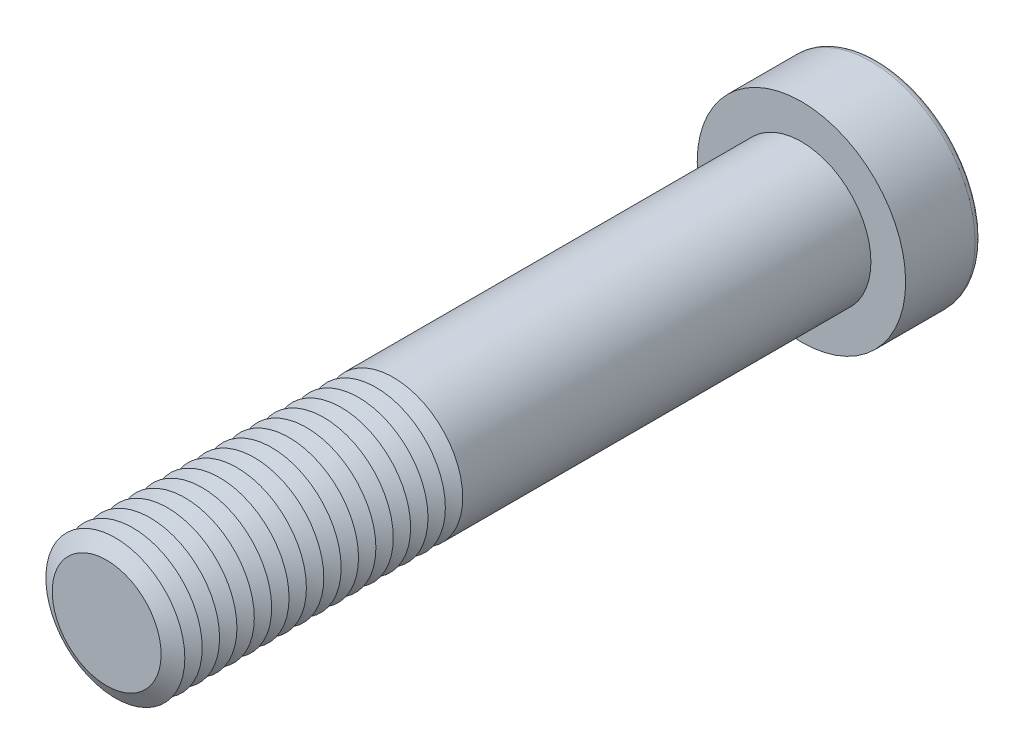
ISO-10303-21;
HEADER;
FILE_DESCRIPTION(('STEP AP214'),'2;1');
FILE_NAME('part.step','',(''),(''),'','','');
FILE_SCHEMA(('AUTOMOTIVE_DESIGN { 1 0 10303 214 1 1 1 1 }'));
ENDSEC;
DATA;
#1=APPLICATION_CONTEXT('core data for automotive mechanical design processes');
#2=APPLICATION_PROTOCOL_DEFINITION('international standard','automotive_design',2000,#1);
#3=PRODUCT_CONTEXT('',#1,'mechanical');
#4=PRODUCT('Part','Part','',(#3));
#5=PRODUCT_RELATED_PRODUCT_CATEGORY('part','',(#4));
#6=PRODUCT_DEFINITION_FORMATION('','',#4);
#7=PRODUCT_DEFINITION_CONTEXT('part definition',#1,'design');
#8=PRODUCT_DEFINITION('design','',#6,#7);
#9=PRODUCT_DEFINITION_SHAPE('','',#8);
#10=(LENGTH_UNIT() NAMED_UNIT(*) SI_UNIT(.MILLI.,.METRE.));
#11=(NAMED_UNIT(*) PLANE_ANGLE_UNIT() SI_UNIT($,.RADIAN.));
#12=(NAMED_UNIT(*) SI_UNIT($,.STERADIAN.) SOLID_ANGLE_UNIT());
#13=UNCERTAINTY_MEASURE_WITH_UNIT(LENGTH_MEASURE(1.E-05),#10,'distance_accuracy_value','');
#14=(GEOMETRIC_REPRESENTATION_CONTEXT(3) GLOBAL_UNCERTAINTY_ASSIGNED_CONTEXT((#13)) GLOBAL_UNIT_ASSIGNED_CONTEXT((#10,
#11,#12)) REPRESENTATION_CONTEXT('',''));
#15=CARTESIAN_POINT('',(0.,0.,0.));
#16=DIRECTION('',(0.,0.,1.));
#17=DIRECTION('',(1.,0.,0.));
#18=AXIS2_PLACEMENT_3D('',#15,#16,#17);
#19=CARTESIAN_POINT('',(0.,0.,91.25));
#20=DIRECTION('',(0.,0.,1.));
#21=DIRECTION('',(1.,0.,0.));
#22=AXIS2_PLACEMENT_3D('',#19,#20,#21);
#23=CONICAL_SURFACE('',#22,10.,1.0471975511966);
#24=CARTESIAN_POINT('',(0.,0.,90.));
#25=DIRECTION('',(0.,0.,1.));
#26=DIRECTION('',(1.,0.,0.));
#27=AXIS2_PLACEMENT_3D('',#24,#25,#26);
#28=CIRCLE('',#27,7.8349364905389);
#29=CARTESIAN_POINT('',(7.8349364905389,0.,90.));
#30=VERTEX_POINT('',#29);
#31=EDGE_CURVE('E314',#30,#30,#28,.T.);
#32=ORIENTED_EDGE('',*,*,#31,.T.);
#33=EDGE_LOOP('',(#32));
#34=FACE_BOUND('',#33,.T.);
#35=CARTESIAN_POINT('',(0.,0.,91.25));
#36=DIRECTION('',(0.,0.,1.));
#37=DIRECTION('',(1.,0.,0.));
#38=AXIS2_PLACEMENT_3D('',#35,#36,#37);
#39=CIRCLE('',#38,10.);
#40=CARTESIAN_POINT('',(10.,0.,91.25));
#41=VERTEX_POINT('',#40);
#42=EDGE_CURVE('E317',#41,#41,#39,.T.);
#43=ORIENTED_EDGE('',*,*,#42,.F.);
#44=EDGE_LOOP('',(#43));
#45=FACE_BOUND('',#44,.T.);
#46=ADVANCED_FACE('F39',(#34,#45),#23,.T.);
#47=CARTESIAN_POINT('',(0.,0.,90.));
#48=DIRECTION('',(0.,0.,-1.));
#49=DIRECTION('',(-1.,0.,0.));
#50=AXIS2_PLACEMENT_3D('',#47,#48,#49);
#51=CONICAL_SURFACE('',#50,7.8349364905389,1.0471975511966);
#52=CARTESIAN_POINT('',(0.,0.,88.75));
#53=DIRECTION('',(0.,0.,1.));
#54=DIRECTION('',(1.,0.,0.));
#55=AXIS2_PLACEMENT_3D('',#52,#53,#54);
#56=CIRCLE('',#55,10.);
#57=CARTESIAN_POINT('',(10.,0.,88.75));
#58=VERTEX_POINT('',#57);
#59=EDGE_CURVE('E324',#58,#58,#56,.T.);
#60=ORIENTED_EDGE('',*,*,#59,.T.);
#61=EDGE_LOOP('',(#60));
#62=FACE_BOUND('',#61,.T.);
#63=ORIENTED_EDGE('',*,*,#31,.F.);
#64=EDGE_LOOP('',(#63));
#65=FACE_BOUND('',#64,.T.);
#66=ADVANCED_FACE('F245',(#62,#65),#51,.T.);
#67=CARTESIAN_POINT('',(0.,0.,100.));
#68=DIRECTION('',(0.,0.,1.));
#69=DIRECTION('',(1.,0.,0.));
#70=AXIS2_PLACEMENT_3D('',#67,#68,#69);
#71=PLANE('',#70);
#72=CARTESIAN_POINT('',(0.,0.,100.));
#73=DIRECTION('',(0.,0.,1.));
#74=DIRECTION('',(1.,0.,0.));
#75=AXIS2_PLACEMENT_3D('',#72,#73,#74);
#76=CIRCLE('',#75,7.8349364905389);
#77=CARTESIAN_POINT('',(7.8349364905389,0.,100.));
#78=VERTEX_POINT('',#77);
#79=EDGE_CURVE('E174',#78,#78,#76,.T.);
#80=ORIENTED_EDGE('',*,*,#79,.T.);
#81=EDGE_LOOP('',(#80));
#82=FACE_BOUND('',#81,.T.);
#83=ADVANCED_FACE('F251',(#82),#71,.T.);
#84=CARTESIAN_POINT('',(0.,0.,100.));
#85=DIRECTION('',(0.,0.,-1.));
#86=DIRECTION('',(-1.,0.,0.));
#87=AXIS2_PLACEMENT_3D('',#84,#85,#86);
#88=CONICAL_SURFACE('',#87,7.8349364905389,1.0471975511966);
#89=CARTESIAN_POINT('',(0.,0.,98.75));
#90=DIRECTION('',(0.,0.,1.));
#91=DIRECTION('',(1.,0.,0.));
#92=AXIS2_PLACEMENT_3D('',#89,#90,#91);
#93=CIRCLE('',#92,10.);
#94=CARTESIAN_POINT('',(10.,0.,98.75));
#95=VERTEX_POINT('',#94);
#96=EDGE_CURVE('E291',#95,#95,#93,.T.);
#97=ORIENTED_EDGE('',*,*,#96,.T.);
#98=EDGE_LOOP('',(#97));
#99=FACE_BOUND('',#98,.T.);
#100=ORIENTED_EDGE('',*,*,#79,.F.);
#101=EDGE_LOOP('',(#100));
#102=FACE_BOUND('',#101,.T.);
#103=ADVANCED_FACE('F199',(#99,#102),#88,.T.);
#104=CARTESIAN_POINT('',(0.,0.,98.75));
#105=DIRECTION('',(0.,0.,1.));
#106=DIRECTION('',(1.,0.,0.));
#107=AXIS2_PLACEMENT_3D('',#104,#105,#106);
#108=CONICAL_SURFACE('',#107,10.,1.0471975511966);
#109=CARTESIAN_POINT('',(0.,0.,97.5));
#110=DIRECTION('',(0.,0.,1.));
#111=DIRECTION('',(1.,0.,0.));
#112=AXIS2_PLACEMENT_3D('',#109,#110,#111);
#113=CIRCLE('',#112,7.8349364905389);
#114=CARTESIAN_POINT('',(7.8349364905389,0.,97.5));
#115=VERTEX_POINT('',#114);
#116=EDGE_CURVE('E288',#115,#115,#113,.T.);
#117=ORIENTED_EDGE('',*,*,#116,.T.);
#118=EDGE_LOOP('',(#117));
#119=FACE_BOUND('',#118,.T.);
#120=ORIENTED_EDGE('',*,*,#96,.F.);
#121=EDGE_LOOP('',(#120));
#122=FACE_BOUND('',#121,.T.);
#123=ADVANCED_FACE('F277',(#119,#122),#108,.T.);
#124=CARTESIAN_POINT('',(0.,0.,97.5));
#125=DIRECTION('',(0.,0.,-1.));
#126=DIRECTION('',(-1.,0.,0.));
#127=AXIS2_PLACEMENT_3D('',#124,#125,#126);
#128=CONICAL_SURFACE('',#127,7.8349364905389,1.0471975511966);
#129=CARTESIAN_POINT('',(0.,0.,96.25));
#130=DIRECTION('',(0.,0.,1.));
#131=DIRECTION('',(1.,0.,0.));
#132=AXIS2_PLACEMENT_3D('',#129,#130,#131);
#133=CIRCLE('',#132,10.);
#134=CARTESIAN_POINT('',(10.,0.,96.25));
#135=VERTEX_POINT('',#134);
#136=EDGE_CURVE('E300',#135,#135,#133,.T.);
#137=ORIENTED_EDGE('',*,*,#136,.T.);
#138=EDGE_LOOP('',(#137));
#139=FACE_BOUND('',#138,.T.);
#140=ORIENTED_EDGE('',*,*,#116,.F.);
#141=EDGE_LOOP('',(#140));
#142=FACE_BOUND('',#141,.T.);
#143=ADVANCED_FACE('F274',(#139,#142),#128,.T.);
#144=CARTESIAN_POINT('',(0.,0.,96.25));
#145=DIRECTION('',(0.,0.,1.));
#146=DIRECTION('',(1.,0.,0.));
#147=AXIS2_PLACEMENT_3D('',#144,#145,#146);
#148=CONICAL_SURFACE('',#147,10.,1.0471975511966);
#149=CARTESIAN_POINT('',(0.,0.,95.));
#150=DIRECTION('',(0.,0.,1.));
#151=DIRECTION('',(1.,0.,0.));
#152=AXIS2_PLACEMENT_3D('',#149,#150,#151);
#153=CIRCLE('',#152,7.8349364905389);
#154=CARTESIAN_POINT('',(7.8349364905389,0.,95.));
#155=VERTEX_POINT('',#154);
#156=EDGE_CURVE('E293',#155,#155,#153,.T.);
#157=ORIENTED_EDGE('',*,*,#156,.T.);
#158=EDGE_LOOP('',(#157));
#159=FACE_BOUND('',#158,.T.);
#160=ORIENTED_EDGE('',*,*,#136,.F.);
#161=EDGE_LOOP('',(#160));
#162=FACE_BOUND('',#161,.T.);
#163=ADVANCED_FACE('F270',(#159,#162),#148,.T.);
#164=CARTESIAN_POINT('',(0.,0.,95.));
#165=DIRECTION('',(0.,0.,-1.));
#166=DIRECTION('',(-1.,0.,0.));
#167=AXIS2_PLACEMENT_3D('',#164,#165,#166);
#168=CONICAL_SURFACE('',#167,7.8349364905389,1.0471975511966);
#169=CARTESIAN_POINT('',(0.,0.,93.75));
#170=DIRECTION('',(0.,0.,1.));
#171=DIRECTION('',(1.,0.,0.));
#172=AXIS2_PLACEMENT_3D('',#169,#170,#171);
#173=CIRCLE('',#172,10.);
#174=CARTESIAN_POINT('',(10.,0.,93.75));
#175=VERTEX_POINT('',#174);
#176=EDGE_CURVE('E310',#175,#175,#173,.T.);
#177=ORIENTED_EDGE('',*,*,#176,.T.);
#178=EDGE_LOOP('',(#177));
#179=FACE_BOUND('',#178,.T.);
#180=ORIENTED_EDGE('',*,*,#156,.F.);
#181=EDGE_LOOP('',(#180));
#182=FACE_BOUND('',#181,.T.);
#183=ADVANCED_FACE('F266',(#179,#182),#168,.T.);
#184=CARTESIAN_POINT('',(0.,0.,93.75));
#185=DIRECTION('',(0.,0.,1.));
#186=DIRECTION('',(1.,0.,0.));
#187=AXIS2_PLACEMENT_3D('',#184,#185,#186);
#188=CONICAL_SURFACE('',#187,10.,1.0471975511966);
#189=CARTESIAN_POINT('',(0.,0.,92.5));
#190=DIRECTION('',(0.,0.,1.));
#191=DIRECTION('',(1.,0.,0.));
#192=AXIS2_PLACEMENT_3D('',#189,#190,#191);
#193=CIRCLE('',#192,7.8349364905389);
#194=CARTESIAN_POINT('',(7.8349364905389,0.,92.5));
#195=VERTEX_POINT('',#194);
#196=EDGE_CURVE('E306',#195,#195,#193,.T.);
#197=ORIENTED_EDGE('',*,*,#196,.T.);
#198=EDGE_LOOP('',(#197));
#199=FACE_BOUND('',#198,.T.);
#200=ORIENTED_EDGE('',*,*,#176,.F.);
#201=EDGE_LOOP('',(#200));
#202=FACE_BOUND('',#201,.T.);
#203=ADVANCED_FACE('F262',(#199,#202),#188,.T.);
#204=CARTESIAN_POINT('',(0.,0.,92.5));
#205=DIRECTION('',(0.,0.,-1.));
#206=DIRECTION('',(-1.,0.,0.));
#207=AXIS2_PLACEMENT_3D('',#204,#205,#206);
#208=CONICAL_SURFACE('',#207,7.8349364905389,1.0471975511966);
#209=ORIENTED_EDGE('',*,*,#42,.T.);
#210=EDGE_LOOP('',(#209));
#211=FACE_BOUND('',#210,.T.);
#212=ORIENTED_EDGE('',*,*,#196,.F.);
#213=EDGE_LOOP('',(#212));
#214=FACE_BOUND('',#213,.T.);
#215=ADVANCED_FACE('F258',(#211,#214),#208,.T.);
#216=CARTESIAN_POINT('',(0.,0.,88.75));
#217=DIRECTION('',(0.,0.,1.));
#218=DIRECTION('',(1.,0.,0.));
#219=AXIS2_PLACEMENT_3D('',#216,#217,#218);
#220=CONICAL_SURFACE('',#219,10.,1.0471975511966);
#221=CARTESIAN_POINT('',(0.,0.,87.5));
#222=DIRECTION('',(0.,0.,1.));
#223=DIRECTION('',(1.,0.,0.));
#224=AXIS2_PLACEMENT_3D('',#221,#222,#223);
#225=CIRCLE('',#224,7.8349364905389);
#226=CARTESIAN_POINT('',(7.8349364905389,0.,87.5));
#227=VERTEX_POINT('',#226);
#228=EDGE_CURVE('E320',#227,#227,#225,.T.);
#229=ORIENTED_EDGE('',*,*,#228,.T.);
#230=EDGE_LOOP('',(#229));
#231=FACE_BOUND('',#230,.T.);
#232=ORIENTED_EDGE('',*,*,#59,.F.);
#233=EDGE_LOOP('',(#232));
#234=FACE_BOUND('',#233,.T.);
#235=ADVANCED_FACE('F261',(#231,#234),#220,.T.);
#236=CARTESIAN_POINT('',(0.,0.,87.5));
#237=DIRECTION('',(0.,0.,-1.));
#238=DIRECTION('',(-1.,0.,0.));
#239=AXIS2_PLACEMENT_3D('',#236,#237,#238);
#240=CONICAL_SURFACE('',#239,7.8349364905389,1.0471975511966);
#241=CARTESIAN_POINT('',(0.,0.,86.25));
#242=DIRECTION('',(0.,0.,1.));
#243=DIRECTION('',(1.,0.,0.));
#244=AXIS2_PLACEMENT_3D('',#241,#242,#243);
#245=CIRCLE('',#244,10.);
#246=CARTESIAN_POINT('',(10.,0.,86.25));
#247=VERTEX_POINT('',#246);
#248=EDGE_CURVE('E332',#247,#247,#245,.T.);
#249=ORIENTED_EDGE('',*,*,#248,.T.);
#250=EDGE_LOOP('',(#249));
#251=FACE_BOUND('',#250,.T.);
#252=ORIENTED_EDGE('',*,*,#228,.F.);
#253=EDGE_LOOP('',(#252));
#254=FACE_BOUND('',#253,.T.);
#255=ADVANCED_FACE('F510',(#251,#254),#240,.T.);
#256=CARTESIAN_POINT('',(0.,0.,86.25));
#257=DIRECTION('',(0.,0.,1.));
#258=DIRECTION('',(1.,0.,0.));
#259=AXIS2_PLACEMENT_3D('',#256,#257,#258);
#260=CONICAL_SURFACE('',#259,10.,1.0471975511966);
#261=CARTESIAN_POINT('',(0.,0.,85.));
#262=DIRECTION('',(0.,0.,1.));
#263=DIRECTION('',(1.,0.,0.));
#264=AXIS2_PLACEMENT_3D('',#261,#262,#263);
#265=CIRCLE('',#264,7.8349364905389);
#266=CARTESIAN_POINT('',(7.8349364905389,0.,85.));
#267=VERTEX_POINT('',#266);
#268=EDGE_CURVE('E328',#267,#267,#265,.T.);
#269=ORIENTED_EDGE('',*,*,#268,.T.);
#270=EDGE_LOOP('',(#269));
#271=FACE_BOUND('',#270,.T.);
#272=ORIENTED_EDGE('',*,*,#248,.F.);
#273=EDGE_LOOP('',(#272));
#274=FACE_BOUND('',#273,.T.);
#275=ADVANCED_FACE('F506',(#271,#274),#260,.T.);
#276=CARTESIAN_POINT('',(0.,0.,85.));
#277=DIRECTION('',(0.,0.,-1.));
#278=DIRECTION('',(-1.,0.,0.));
#279=AXIS2_PLACEMENT_3D('',#276,#277,#278);
#280=CONICAL_SURFACE('',#279,7.8349364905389,1.0471975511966);
#281=CARTESIAN_POINT('',(0.,0.,83.75));
#282=DIRECTION('',(0.,0.,1.));
#283=DIRECTION('',(1.,0.,0.));
#284=AXIS2_PLACEMENT_3D('',#281,#282,#283);
#285=CIRCLE('',#284,10.);
#286=CARTESIAN_POINT('',(10.,0.,83.75));
#287=VERTEX_POINT('',#286);
#288=EDGE_CURVE('E340',#287,#287,#285,.T.);
#289=ORIENTED_EDGE('',*,*,#288,.T.);
#290=EDGE_LOOP('',(#289));
#291=FACE_BOUND('',#290,.T.);
#292=ORIENTED_EDGE('',*,*,#268,.F.);
#293=EDGE_LOOP('',(#292));
#294=FACE_BOUND('',#293,.T.);
#295=ADVANCED_FACE('F502',(#291,#294),#280,.T.);
#296=CARTESIAN_POINT('',(0.,0.,83.75));
#297=DIRECTION('',(0.,0.,1.));
#298=DIRECTION('',(1.,0.,0.));
#299=AXIS2_PLACEMENT_3D('',#296,#297,#298);
#300=CONICAL_SURFACE('',#299,10.,1.0471975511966);
#301=CARTESIAN_POINT('',(0.,0.,82.5));
#302=DIRECTION('',(0.,0.,1.));
#303=DIRECTION('',(1.,0.,0.));
#304=AXIS2_PLACEMENT_3D('',#301,#302,#303);
#305=CIRCLE('',#304,7.8349364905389);
#306=CARTESIAN_POINT('',(7.8349364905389,0.,82.5));
#307=VERTEX_POINT('',#306);
#308=EDGE_CURVE('E336',#307,#307,#305,.T.);
#309=ORIENTED_EDGE('',*,*,#308,.T.);
#310=EDGE_LOOP('',(#309));
#311=FACE_BOUND('',#310,.T.);
#312=ORIENTED_EDGE('',*,*,#288,.F.);
#313=EDGE_LOOP('',(#312));
#314=FACE_BOUND('',#313,.T.);
#315=ADVANCED_FACE('F498',(#311,#314),#300,.T.);
#316=CARTESIAN_POINT('',(0.,0.,82.5));
#317=DIRECTION('',(0.,0.,-1.));
#318=DIRECTION('',(-1.,0.,0.));
#319=AXIS2_PLACEMENT_3D('',#316,#317,#318);
#320=CONICAL_SURFACE('',#319,7.8349364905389,1.0471975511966);
#321=CARTESIAN_POINT('',(0.,0.,81.25));
#322=DIRECTION('',(0.,0.,1.));
#323=DIRECTION('',(1.,0.,0.));
#324=AXIS2_PLACEMENT_3D('',#321,#322,#323);
#325=CIRCLE('',#324,10.);
#326=CARTESIAN_POINT('',(10.,0.,81.25));
#327=VERTEX_POINT('',#326);
#328=EDGE_CURVE('E348',#327,#327,#325,.T.);
#329=ORIENTED_EDGE('',*,*,#328,.T.);
#330=EDGE_LOOP('',(#329));
#331=FACE_BOUND('',#330,.T.);
#332=ORIENTED_EDGE('',*,*,#308,.F.);
#333=EDGE_LOOP('',(#332));
#334=FACE_BOUND('',#333,.T.);
#335=ADVANCED_FACE('F494',(#331,#334),#320,.T.);
#336=CARTESIAN_POINT('',(0.,0.,81.25));
#337=DIRECTION('',(0.,0.,1.));
#338=DIRECTION('',(1.,0.,0.));
#339=AXIS2_PLACEMENT_3D('',#336,#337,#338);
#340=CONICAL_SURFACE('',#339,10.,1.0471975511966);
#341=CARTESIAN_POINT('',(0.,0.,80.));
#342=DIRECTION('',(0.,0.,1.));
#343=DIRECTION('',(1.,0.,0.));
#344=AXIS2_PLACEMENT_3D('',#341,#342,#343);
#345=CIRCLE('',#344,7.8349364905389);
#346=CARTESIAN_POINT('',(7.8349364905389,0.,80.));
#347=VERTEX_POINT('',#346);
#348=EDGE_CURVE('E344',#347,#347,#345,.T.);
#349=ORIENTED_EDGE('',*,*,#348,.T.);
#350=EDGE_LOOP('',(#349));
#351=FACE_BOUND('',#350,.T.);
#352=ORIENTED_EDGE('',*,*,#328,.F.);
#353=EDGE_LOOP('',(#352));
#354=FACE_BOUND('',#353,.T.);
#355=ADVANCED_FACE('F490',(#351,#354),#340,.T.);
#356=CARTESIAN_POINT('',(0.,0.,80.));
#357=DIRECTION('',(0.,0.,-1.));
#358=DIRECTION('',(-1.,0.,0.));
#359=AXIS2_PLACEMENT_3D('',#356,#357,#358);
#360=CONICAL_SURFACE('',#359,7.8349364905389,1.0471975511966);
#361=CARTESIAN_POINT('',(0.,0.,78.75));
#362=DIRECTION('',(0.,0.,1.));
#363=DIRECTION('',(1.,0.,0.));
#364=AXIS2_PLACEMENT_3D('',#361,#362,#363);
#365=CIRCLE('',#364,10.);
#366=CARTESIAN_POINT('',(10.,0.,78.75));
#367=VERTEX_POINT('',#366);
#368=EDGE_CURVE('E356',#367,#367,#365,.T.);
#369=ORIENTED_EDGE('',*,*,#368,.T.);
#370=EDGE_LOOP('',(#369));
#371=FACE_BOUND('',#370,.T.);
#372=ORIENTED_EDGE('',*,*,#348,.F.);
#373=EDGE_LOOP('',(#372));
#374=FACE_BOUND('',#373,.T.);
#375=ADVANCED_FACE('F486',(#371,#374),#360,.T.);
#376=CARTESIAN_POINT('',(0.,0.,78.75));
#377=DIRECTION('',(0.,0.,1.));
#378=DIRECTION('',(1.,0.,0.));
#379=AXIS2_PLACEMENT_3D('',#376,#377,#378);
#380=CONICAL_SURFACE('',#379,10.,1.0471975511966);
#381=CARTESIAN_POINT('',(0.,0.,77.5));
#382=DIRECTION('',(0.,0.,1.));
#383=DIRECTION('',(1.,0.,0.));
#384=AXIS2_PLACEMENT_3D('',#381,#382,#383);
#385=CIRCLE('',#384,7.8349364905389);
#386=CARTESIAN_POINT('',(7.8349364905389,0.,77.5));
#387=VERTEX_POINT('',#386);
#388=EDGE_CURVE('E352',#387,#387,#385,.T.);
#389=ORIENTED_EDGE('',*,*,#388,.T.);
#390=EDGE_LOOP('',(#389));
#391=FACE_BOUND('',#390,.T.);
#392=ORIENTED_EDGE('',*,*,#368,.F.);
#393=EDGE_LOOP('',(#392));
#394=FACE_BOUND('',#393,.T.);
#395=ADVANCED_FACE('F482',(#391,#394),#380,.T.);
#396=CARTESIAN_POINT('',(0.,0.,77.5));
#397=DIRECTION('',(0.,0.,-1.));
#398=DIRECTION('',(-1.,0.,0.));
#399=AXIS2_PLACEMENT_3D('',#396,#397,#398);
#400=CONICAL_SURFACE('',#399,7.8349364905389,1.0471975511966);
#401=CARTESIAN_POINT('',(0.,0.,76.25));
#402=DIRECTION('',(0.,0.,1.));
#403=DIRECTION('',(1.,0.,0.));
#404=AXIS2_PLACEMENT_3D('',#401,#402,#403);
#405=CIRCLE('',#404,10.);
#406=CARTESIAN_POINT('',(10.,0.,76.25));
#407=VERTEX_POINT('',#406);
#408=EDGE_CURVE('E363',#407,#407,#405,.T.);
#409=ORIENTED_EDGE('',*,*,#408,.T.);
#410=EDGE_LOOP('',(#409));
#411=FACE_BOUND('',#410,.T.);
#412=ORIENTED_EDGE('',*,*,#388,.F.);
#413=EDGE_LOOP('',(#412));
#414=FACE_BOUND('',#413,.T.);
#415=ADVANCED_FACE('F478',(#411,#414),#400,.T.);
#416=CARTESIAN_POINT('',(0.,0.,76.25));
#417=DIRECTION('',(0.,0.,1.));
#418=DIRECTION('',(1.,0.,0.));
#419=AXIS2_PLACEMENT_3D('',#416,#417,#418);
#420=CONICAL_SURFACE('',#419,10.,1.0471975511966);
#421=CARTESIAN_POINT('',(0.,0.,75.));
#422=DIRECTION('',(0.,0.,1.));
#423=DIRECTION('',(1.,0.,0.));
#424=AXIS2_PLACEMENT_3D('',#421,#422,#423);
#425=CIRCLE('',#424,7.8349364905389);
#426=CARTESIAN_POINT('',(7.8349364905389,0.,75.));
#427=VERTEX_POINT('',#426);
#428=EDGE_CURVE('E359',#427,#427,#425,.T.);
#429=ORIENTED_EDGE('',*,*,#428,.T.);
#430=EDGE_LOOP('',(#429));
#431=FACE_BOUND('',#430,.T.);
#432=ORIENTED_EDGE('',*,*,#408,.F.);
#433=EDGE_LOOP('',(#432));
#434=FACE_BOUND('',#433,.T.);
#435=ADVANCED_FACE('F474',(#431,#434),#420,.T.);
#436=CARTESIAN_POINT('',(0.,0.,75.));
#437=DIRECTION('',(0.,0.,-1.));
#438=DIRECTION('',(-1.,0.,0.));
#439=AXIS2_PLACEMENT_3D('',#436,#437,#438);
#440=CONICAL_SURFACE('',#439,7.8349364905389,1.0471975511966);
#441=CARTESIAN_POINT('',(0.,0.,73.75));
#442=DIRECTION('',(0.,0.,1.));
#443=DIRECTION('',(1.,0.,0.));
#444=AXIS2_PLACEMENT_3D('',#441,#442,#443);
#445=CIRCLE('',#444,10.);
#446=CARTESIAN_POINT('',(10.,0.,73.75));
#447=VERTEX_POINT('',#446);
#448=EDGE_CURVE('E370',#447,#447,#445,.T.);
#449=ORIENTED_EDGE('',*,*,#448,.T.);
#450=EDGE_LOOP('',(#449));
#451=FACE_BOUND('',#450,.T.);
#452=ORIENTED_EDGE('',*,*,#428,.F.);
#453=EDGE_LOOP('',(#452));
#454=FACE_BOUND('',#453,.T.);
#455=ADVANCED_FACE('F470',(#451,#454),#440,.T.);
#456=CARTESIAN_POINT('',(0.,0.,73.75));
#457=DIRECTION('',(0.,0.,1.));
#458=DIRECTION('',(1.,0.,0.));
#459=AXIS2_PLACEMENT_3D('',#456,#457,#458);
#460=CONICAL_SURFACE('',#459,10.,1.0471975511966);
#461=CARTESIAN_POINT('',(0.,0.,72.5));
#462=DIRECTION('',(0.,0.,1.));
#463=DIRECTION('',(1.,0.,0.));
#464=AXIS2_PLACEMENT_3D('',#461,#462,#463);
#465=CIRCLE('',#464,7.8349364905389);
#466=CARTESIAN_POINT('',(7.8349364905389,0.,72.5));
#467=VERTEX_POINT('',#466);
#468=EDGE_CURVE('E367',#467,#467,#465,.T.);
#469=ORIENTED_EDGE('',*,*,#468,.T.);
#470=EDGE_LOOP('',(#469));
#471=FACE_BOUND('',#470,.T.);
#472=ORIENTED_EDGE('',*,*,#448,.F.);
#473=EDGE_LOOP('',(#472));
#474=FACE_BOUND('',#473,.T.);
#475=ADVANCED_FACE('F466',(#471,#474),#460,.T.);
#476=CARTESIAN_POINT('',(0.,0.,72.5));
#477=DIRECTION('',(0.,0.,-1.));
#478=DIRECTION('',(-1.,0.,0.));
#479=AXIS2_PLACEMENT_3D('',#476,#477,#478);
#480=CONICAL_SURFACE('',#479,7.8349364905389,1.0471975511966);
#481=CARTESIAN_POINT('',(0.,0.,71.25));
#482=DIRECTION('',(0.,0.,1.));
#483=DIRECTION('',(1.,0.,0.));
#484=AXIS2_PLACEMENT_3D('',#481,#482,#483);
#485=CIRCLE('',#484,10.);
#486=CARTESIAN_POINT('',(10.,0.,71.25));
#487=VERTEX_POINT('',#486);
#488=EDGE_CURVE('E378',#487,#487,#485,.T.);
#489=ORIENTED_EDGE('',*,*,#488,.T.);
#490=EDGE_LOOP('',(#489));
#491=FACE_BOUND('',#490,.T.);
#492=ORIENTED_EDGE('',*,*,#468,.F.);
#493=EDGE_LOOP('',(#492));
#494=FACE_BOUND('',#493,.T.);
#495=ADVANCED_FACE('F462',(#491,#494),#480,.T.);
#496=CARTESIAN_POINT('',(0.,0.,71.25));
#497=DIRECTION('',(0.,0.,1.));
#498=DIRECTION('',(1.,0.,0.));
#499=AXIS2_PLACEMENT_3D('',#496,#497,#498);
#500=CONICAL_SURFACE('',#499,10.,1.0471975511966);
#501=CARTESIAN_POINT('',(0.,0.,70.));
#502=DIRECTION('',(0.,0.,1.));
#503=DIRECTION('',(1.,0.,0.));
#504=AXIS2_PLACEMENT_3D('',#501,#502,#503);
#505=CIRCLE('',#504,7.8349364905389);
#506=CARTESIAN_POINT('',(7.8349364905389,0.,70.));
#507=VERTEX_POINT('',#506);
#508=EDGE_CURVE('E374',#507,#507,#505,.T.);
#509=ORIENTED_EDGE('',*,*,#508,.T.);
#510=EDGE_LOOP('',(#509));
#511=FACE_BOUND('',#510,.T.);
#512=ORIENTED_EDGE('',*,*,#488,.F.);
#513=EDGE_LOOP('',(#512));
#514=FACE_BOUND('',#513,.T.);
#515=ADVANCED_FACE('F458',(#511,#514),#500,.T.);
#516=CARTESIAN_POINT('',(0.,0.,70.));
#517=DIRECTION('',(0.,0.,-1.));
#518=DIRECTION('',(-1.,0.,0.));
#519=AXIS2_PLACEMENT_3D('',#516,#517,#518);
#520=CONICAL_SURFACE('',#519,7.8349364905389,1.0471975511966);
#521=CARTESIAN_POINT('',(0.,0.,68.75));
#522=DIRECTION('',(0.,0.,1.));
#523=DIRECTION('',(1.,0.,0.));
#524=AXIS2_PLACEMENT_3D('',#521,#522,#523);
#525=CIRCLE('',#524,10.);
#526=CARTESIAN_POINT('',(10.,0.,68.75));
#527=VERTEX_POINT('',#526);
#528=EDGE_CURVE('E386',#527,#527,#525,.T.);
#529=ORIENTED_EDGE('',*,*,#528,.T.);
#530=EDGE_LOOP('',(#529));
#531=FACE_BOUND('',#530,.T.);
#532=ORIENTED_EDGE('',*,*,#508,.F.);
#533=EDGE_LOOP('',(#532));
#534=FACE_BOUND('',#533,.T.);
#535=ADVANCED_FACE('F454',(#531,#534),#520,.T.);
#536=CARTESIAN_POINT('',(0.,0.,68.75));
#537=DIRECTION('',(0.,0.,1.));
#538=DIRECTION('',(1.,0.,0.));
#539=AXIS2_PLACEMENT_3D('',#536,#537,#538);
#540=CONICAL_SURFACE('',#539,10.,1.0471975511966);
#541=CARTESIAN_POINT('',(0.,0.,67.5));
#542=DIRECTION('',(0.,0.,1.));
#543=DIRECTION('',(1.,0.,0.));
#544=AXIS2_PLACEMENT_3D('',#541,#542,#543);
#545=CIRCLE('',#544,7.8349364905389);
#546=CARTESIAN_POINT('',(7.8349364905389,0.,67.5));
#547=VERTEX_POINT('',#546);
#548=EDGE_CURVE('E382',#547,#547,#545,.T.);
#549=ORIENTED_EDGE('',*,*,#548,.T.);
#550=EDGE_LOOP('',(#549));
#551=FACE_BOUND('',#550,.T.);
#552=ORIENTED_EDGE('',*,*,#528,.F.);
#553=EDGE_LOOP('',(#552));
#554=FACE_BOUND('',#553,.T.);
#555=ADVANCED_FACE('F450',(#551,#554),#540,.T.);
#556=CARTESIAN_POINT('',(0.,0.,67.5));
#557=DIRECTION('',(0.,0.,-1.));
#558=DIRECTION('',(-1.,0.,0.));
#559=AXIS2_PLACEMENT_3D('',#556,#557,#558);
#560=CONICAL_SURFACE('',#559,7.8349364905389,1.0471975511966);
#561=CARTESIAN_POINT('',(0.,0.,66.25));
#562=DIRECTION('',(0.,0.,1.));
#563=DIRECTION('',(1.,0.,0.));
#564=AXIS2_PLACEMENT_3D('',#561,#562,#563);
#565=CIRCLE('',#564,10.);
#566=CARTESIAN_POINT('',(10.,0.,66.25));
#567=VERTEX_POINT('',#566);
#568=EDGE_CURVE('E394',#567,#567,#565,.T.);
#569=ORIENTED_EDGE('',*,*,#568,.T.);
#570=EDGE_LOOP('',(#569));
#571=FACE_BOUND('',#570,.T.);
#572=ORIENTED_EDGE('',*,*,#548,.F.);
#573=EDGE_LOOP('',(#572));
#574=FACE_BOUND('',#573,.T.);
#575=ADVANCED_FACE('F446',(#571,#574),#560,.T.);
#576=CARTESIAN_POINT('',(0.,0.,66.25));
#577=DIRECTION('',(0.,0.,1.));
#578=DIRECTION('',(1.,0.,0.));
#579=AXIS2_PLACEMENT_3D('',#576,#577,#578);
#580=CONICAL_SURFACE('',#579,10.,1.0471975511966);
#581=CARTESIAN_POINT('',(0.,0.,65.));
#582=DIRECTION('',(0.,0.,1.));
#583=DIRECTION('',(1.,0.,0.));
#584=AXIS2_PLACEMENT_3D('',#581,#582,#583);
#585=CIRCLE('',#584,7.8349364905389);
#586=CARTESIAN_POINT('',(7.8349364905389,0.,65.));
#587=VERTEX_POINT('',#586);
#588=EDGE_CURVE('E390',#587,#587,#585,.T.);
#589=ORIENTED_EDGE('',*,*,#588,.T.);
#590=EDGE_LOOP('',(#589));
#591=FACE_BOUND('',#590,.T.);
#592=ORIENTED_EDGE('',*,*,#568,.F.);
#593=EDGE_LOOP('',(#592));
#594=FACE_BOUND('',#593,.T.);
#595=ADVANCED_FACE('F442',(#591,#594),#580,.T.);
#596=CARTESIAN_POINT('',(0.,0.,65.));
#597=DIRECTION('',(0.,0.,-1.));
#598=DIRECTION('',(-1.,0.,0.));
#599=AXIS2_PLACEMENT_3D('',#596,#597,#598);
#600=CONICAL_SURFACE('',#599,7.8349364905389,1.0471975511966);
#601=CARTESIAN_POINT('',(0.,0.,63.75));
#602=DIRECTION('',(0.,0.,1.));
#603=DIRECTION('',(1.,0.,0.));
#604=AXIS2_PLACEMENT_3D('',#601,#602,#603);
#605=CIRCLE('',#604,10.);
#606=CARTESIAN_POINT('',(10.,0.,63.75));
#607=VERTEX_POINT('',#606);
#608=EDGE_CURVE('E402',#607,#607,#605,.T.);
#609=ORIENTED_EDGE('',*,*,#608,.T.);
#610=EDGE_LOOP('',(#609));
#611=FACE_BOUND('',#610,.T.);
#612=ORIENTED_EDGE('',*,*,#588,.F.);
#613=EDGE_LOOP('',(#612));
#614=FACE_BOUND('',#613,.T.);
#615=ADVANCED_FACE('F438',(#611,#614),#600,.T.);
#616=CARTESIAN_POINT('',(0.,0.,63.75));
#617=DIRECTION('',(0.,0.,1.));
#618=DIRECTION('',(1.,0.,0.));
#619=AXIS2_PLACEMENT_3D('',#616,#617,#618);
#620=CONICAL_SURFACE('',#619,10.,1.0471975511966);
#621=CARTESIAN_POINT('',(0.,0.,62.5));
#622=DIRECTION('',(0.,0.,1.));
#623=DIRECTION('',(1.,0.,0.));
#624=AXIS2_PLACEMENT_3D('',#621,#622,#623);
#625=CIRCLE('',#624,7.8349364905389);
#626=CARTESIAN_POINT('',(7.8349364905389,0.,62.5));
#627=VERTEX_POINT('',#626);
#628=EDGE_CURVE('E398',#627,#627,#625,.T.);
#629=ORIENTED_EDGE('',*,*,#628,.T.);
#630=EDGE_LOOP('',(#629));
#631=FACE_BOUND('',#630,.T.);
#632=ORIENTED_EDGE('',*,*,#608,.F.);
#633=EDGE_LOOP('',(#632));
#634=FACE_BOUND('',#633,.T.);
#635=ADVANCED_FACE('F433',(#631,#634),#620,.T.);
#636=CARTESIAN_POINT('',(0.,0.,62.5));
#637=DIRECTION('',(0.,0.,-1.));
#638=DIRECTION('',(-1.,0.,0.));
#639=AXIS2_PLACEMENT_3D('',#636,#637,#638);
#640=CONICAL_SURFACE('',#639,7.8349364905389,1.0471975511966);
#641=CARTESIAN_POINT('',(0.,0.,61.25));
#642=DIRECTION('',(0.,0.,1.));
#643=DIRECTION('',(1.,0.,0.));
#644=AXIS2_PLACEMENT_3D('',#641,#642,#643);
#645=CIRCLE('',#644,10.);
#646=CARTESIAN_POINT('',(10.,0.,61.25));
#647=VERTEX_POINT('',#646);
#648=EDGE_CURVE('E414',#647,#647,#645,.T.);
#649=ORIENTED_EDGE('',*,*,#648,.T.);
#650=EDGE_LOOP('',(#649));
#651=FACE_BOUND('',#650,.T.);
#652=ORIENTED_EDGE('',*,*,#628,.F.);
#653=EDGE_LOOP('',(#652));
#654=FACE_BOUND('',#653,.T.);
#655=ADVANCED_FACE('F419',(#651,#654),#640,.T.);
#656=CARTESIAN_POINT('',(0.,0.,61.25));
#657=DIRECTION('',(0.,0.,1.));
#658=DIRECTION('',(1.,0.,0.));
#659=AXIS2_PLACEMENT_3D('',#656,#657,#658);
#660=CONICAL_SURFACE('',#659,10.,1.0471975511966);
#661=CARTESIAN_POINT('',(0.,0.,60.));
#662=DIRECTION('',(0.,0.,1.));
#663=DIRECTION('',(1.,0.,0.));
#664=AXIS2_PLACEMENT_3D('',#661,#662,#663);
#665=CIRCLE('',#664,7.8349364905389);
#666=CARTESIAN_POINT('',(7.8349364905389,0.,60.));
#667=VERTEX_POINT('',#666);
#668=EDGE_CURVE('E406',#667,#667,#665,.T.);
#669=ORIENTED_EDGE('',*,*,#668,.T.);
#670=EDGE_LOOP('',(#669));
#671=FACE_BOUND('',#670,.T.);
#672=ORIENTED_EDGE('',*,*,#648,.F.);
#673=EDGE_LOOP('',(#672));
#674=FACE_BOUND('',#673,.T.);
#675=ADVANCED_FACE('F422',(#671,#674),#660,.T.);
#676=CARTESIAN_POINT('',(0.,0.,60.));
#677=DIRECTION('',(0.,0.,-1.));
#678=DIRECTION('',(-1.,0.,0.));
#679=AXIS2_PLACEMENT_3D('',#676,#677,#678);
#680=CONICAL_SURFACE('',#679,7.8349364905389,1.0471975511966);
#681=CARTESIAN_POINT('',(0.,0.,58.75));
#682=DIRECTION('',(0.,0.,1.));
#683=DIRECTION('',(1.,0.,0.));
#684=AXIS2_PLACEMENT_3D('',#681,#682,#683);
#685=CIRCLE('',#684,10.);
#686=CARTESIAN_POINT('',(10.,0.,58.75));
#687=VERTEX_POINT('',#686);
#688=EDGE_CURVE('E410',#687,#687,#685,.T.);
#689=ORIENTED_EDGE('',*,*,#688,.T.);
#690=EDGE_LOOP('',(#689));
#691=FACE_BOUND('',#690,.T.);
#692=ORIENTED_EDGE('',*,*,#668,.F.);
#693=EDGE_LOOP('',(#692));
#694=FACE_BOUND('',#693,.T.);
#695=ADVANCED_FACE('F424',(#691,#694),#680,.T.);
#696=CARTESIAN_POINT('',(0.,0.,-0.499999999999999));
#697=DIRECTION('',(0.,0.,-1.));
#698=DIRECTION('',(-1.,0.,0.));
#699=AXIS2_PLACEMENT_3D('',#696,#697,#698);
#700=CONICAL_SURFACE('',#699,7.,1.0471975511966);
#701=CARTESIAN_POINT('',(0.,0.,3.54145188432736));
#702=VERTEX_POINT('',#701);
#703=VERTEX_LOOP('',#702);
#704=FACE_BOUND('',#703,.T.);
#705=CARTESIAN_POINT('',(0.,0.,-0.499999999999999));
#706=DIRECTION('',(0.,0.,-1.));
#707=DIRECTION('',(-1.,0.,0.));
#708=AXIS2_PLACEMENT_3D('',#705,#706,#707);
#709=CIRCLE('',#708,7.);
#710=CARTESIAN_POINT('',(-6.06217782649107,3.5,-0.499999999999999));
#711=VERTEX_POINT('',#710);
#712=CARTESIAN_POINT('',(0.,7.,-0.499999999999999));
#713=VERTEX_POINT('',#712);
#714=EDGE_CURVE('E149',#711,#713,#709,.T.);
#715=ORIENTED_EDGE('',*,*,#714,.T.);
#716=CARTESIAN_POINT('',(0.,0.,-0.499999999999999));
#717=DIRECTION('',(0.,0.,-1.));
#718=DIRECTION('',(-1.,0.,0.));
#719=AXIS2_PLACEMENT_3D('',#716,#717,#718);
#720=CIRCLE('',#719,7.);
#721=CARTESIAN_POINT('',(6.06217782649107,3.5,-0.499999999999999));
#722=VERTEX_POINT('',#721);
#723=EDGE_CURVE('E54',#713,#722,#720,.T.);
#724=ORIENTED_EDGE('',*,*,#723,.T.);
#725=CARTESIAN_POINT('',(6.06217782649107,-3.5,-0.499999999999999));
#726=VERTEX_POINT('',#725);
#727=EDGE_CURVE('E1025',#722,#726,#720,.T.);
#728=ORIENTED_EDGE('',*,*,#727,.T.);
#729=CARTESIAN_POINT('',(0.,-7.,-0.499999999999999));
#730=VERTEX_POINT('',#729);
#731=EDGE_CURVE('E1023',#726,#730,#720,.T.);
#732=ORIENTED_EDGE('',*,*,#731,.T.);
#733=CARTESIAN_POINT('',(-6.06217782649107,-3.5,-0.499999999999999));
#734=VERTEX_POINT('',#733);
#735=EDGE_CURVE('E1018',#730,#734,#720,.T.);
#736=ORIENTED_EDGE('',*,*,#735,.T.);
#737=EDGE_CURVE('E1016',#734,#711,#720,.T.);
#738=ORIENTED_EDGE('',*,*,#737,.T.);
#739=EDGE_LOOP('',(#715,#724,#728,#732,#736,#738));
#740=FACE_BOUND('',#739,.T.);
#741=ADVANCED_FACE('F201',(#704,#740),#700,.F.);
#742=CARTESIAN_POINT('',(0.,0.,-0.499999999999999));
#743=DIRECTION('',(0.,0.,-1.));
#744=DIRECTION('',(-1.,0.,0.));
#745=AXIS2_PLACEMENT_3D('',#742,#743,#744);
#746=PLANE('',#745);
#747=ORIENTED_EDGE('',*,*,#723,.F.);
#748=DIRECTION('',(1.,0.,0.));
#749=VECTOR('',#748,1.);
#750=CARTESIAN_POINT('',(-4.04145188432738,7.,-0.499999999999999));
#751=LINE('',#750,#749);
#752=CARTESIAN_POINT('',(4.04145188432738,7.,-0.499999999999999));
#753=VERTEX_POINT('',#752);
#754=EDGE_CURVE('E1068',#713,#753,#751,.T.);
#755=ORIENTED_EDGE('',*,*,#754,.T.);
#756=DIRECTION('',(0.5,-0.866025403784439,0.));
#757=VECTOR('',#756,1.);
#758=CARTESIAN_POINT('',(4.04145188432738,7.,-0.499999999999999));
#759=LINE('',#758,#757);
#760=EDGE_CURVE('E155',#753,#722,#759,.T.);
#761=ORIENTED_EDGE('',*,*,#760,.T.);
#762=EDGE_LOOP('',(#747,#755,#761));
#763=FACE_BOUND('',#762,.T.);
#764=ADVANCED_FACE('F605',(#763),#746,.T.);
#765=ORIENTED_EDGE('',*,*,#727,.F.);
#766=CARTESIAN_POINT('',(8.08290376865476,0.,-0.499999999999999));
#767=VERTEX_POINT('',#766);
#768=EDGE_CURVE('E1062',#722,#767,#759,.T.);
#769=ORIENTED_EDGE('',*,*,#768,.T.);
#770=DIRECTION('',(-0.5,-0.866025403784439,0.));
#771=VECTOR('',#770,1.);
#772=CARTESIAN_POINT('',(8.08290376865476,0.,-0.499999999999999));
#773=LINE('',#772,#771);
#774=EDGE_CURVE('E1037',#767,#726,#773,.T.);
#775=ORIENTED_EDGE('',*,*,#774,.T.);
#776=EDGE_LOOP('',(#765,#769,#775));
#777=FACE_BOUND('',#776,.T.);
#778=ADVANCED_FACE('F615',(#777),#746,.T.);
#779=ORIENTED_EDGE('',*,*,#731,.F.);
#780=CARTESIAN_POINT('',(4.04145188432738,-7.,-0.499999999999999));
#781=VERTEX_POINT('',#780);
#782=EDGE_CURVE('E1039',#726,#781,#773,.T.);
#783=ORIENTED_EDGE('',*,*,#782,.T.);
#784=DIRECTION('',(-1.,0.,0.));
#785=VECTOR('',#784,1.);
#786=CARTESIAN_POINT('',(4.04145188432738,-7.,-0.499999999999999));
#787=LINE('',#786,#785);
#788=EDGE_CURVE('E990',#781,#730,#787,.T.);
#789=ORIENTED_EDGE('',*,*,#788,.T.);
#790=EDGE_LOOP('',(#779,#783,#789));
#791=FACE_BOUND('',#790,.T.);
#792=ADVANCED_FACE('F625',(#791),#746,.T.);
#793=ORIENTED_EDGE('',*,*,#735,.F.);
#794=CARTESIAN_POINT('',(-4.04145188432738,-7.,-0.499999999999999));
#795=VERTEX_POINT('',#794);
#796=EDGE_CURVE('E1033',#730,#795,#787,.T.);
#797=ORIENTED_EDGE('',*,*,#796,.T.);
#798=DIRECTION('',(-0.5,0.866025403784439,0.));
#799=VECTOR('',#798,1.);
#800=CARTESIAN_POINT('',(-4.04145188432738,-7.,-0.499999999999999));
#801=LINE('',#800,#799);
#802=EDGE_CURVE('E1035',#795,#734,#801,.T.);
#803=ORIENTED_EDGE('',*,*,#802,.T.);
#804=EDGE_LOOP('',(#793,#797,#803));
#805=FACE_BOUND('',#804,.T.);
#806=ADVANCED_FACE('F633',(#805),#746,.T.);
#807=ORIENTED_EDGE('',*,*,#737,.F.);
#808=CARTESIAN_POINT('',(-8.08290376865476,0.,-0.499999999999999));
#809=VERTEX_POINT('',#808);
#810=EDGE_CURVE('E1041',#734,#809,#801,.T.);
#811=ORIENTED_EDGE('',*,*,#810,.T.);
#812=DIRECTION('',(0.5,0.866025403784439,0.));
#813=VECTOR('',#812,1.);
#814=CARTESIAN_POINT('',(-8.08290376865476,0.,-0.499999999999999));
#815=LINE('',#814,#813);
#816=EDGE_CURVE('E158',#809,#711,#815,.T.);
#817=ORIENTED_EDGE('',*,*,#816,.T.);
#818=EDGE_LOOP('',(#807,#811,#817));
#819=FACE_BOUND('',#818,.T.);
#820=ADVANCED_FACE('F231',(#819),#746,.T.);
#821=ORIENTED_EDGE('',*,*,#714,.F.);
#822=CARTESIAN_POINT('',(-4.04145188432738,7.,-0.499999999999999));
#823=VERTEX_POINT('',#822);
#824=EDGE_CURVE('E1048',#711,#823,#815,.T.);
#825=ORIENTED_EDGE('',*,*,#824,.T.);
#826=EDGE_CURVE('E1065',#823,#713,#751,.T.);
#827=ORIENTED_EDGE('',*,*,#826,.T.);
#828=EDGE_LOOP('',(#821,#825,#827));
#829=FACE_BOUND('',#828,.T.);
#830=ADVANCED_FACE('F617',(#829),#746,.T.);
#831=CARTESIAN_POINT('',(-4.04145188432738,7.,-0.499999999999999));
#832=DIRECTION('',(0.,1.,0.));
#833=DIRECTION('',(0.,0.,1.));
#834=AXIS2_PLACEMENT_3D('',#831,#832,#833);
#835=PLANE('',#834);
#836=DIRECTION('',(0.,0.,-1.));
#837=VECTOR('',#836,1.);
#838=CARTESIAN_POINT('',(-4.04145188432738,7.,-0.499999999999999));
#839=LINE('',#838,#837);
#840=CARTESIAN_POINT('',(-4.04145188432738,7.,-11.));
#841=VERTEX_POINT('',#840);
#842=EDGE_CURVE('E147',#823,#841,#839,.T.);
#843=ORIENTED_EDGE('',*,*,#842,.T.);
#844=CARTESIAN_POINT('',(-10.5504265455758,7.,-12.226809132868));
#845=CARTESIAN_POINT('',(-10.234342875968,7.,-12.1562549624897));
#846=CARTESIAN_POINT('',(-9.91805751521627,7.,-12.0865877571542));
#847=CARTESIAN_POINT('',(-9.28498462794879,7.,-11.9495060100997));
#848=CARTESIAN_POINT('',(-8.9681970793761,7.,-11.8820915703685));
#849=CARTESIAN_POINT('',(-8.3337216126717,7.,-11.7499322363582));
#850=CARTESIAN_POINT('',(-8.0160331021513,7.,-11.6851901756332));
#851=CARTESIAN_POINT('',(-7.37998429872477,7.,-11.5590967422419));
#852=CARTESIAN_POINT('',(-7.0616240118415,7.,-11.4977453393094));
#853=CARTESIAN_POINT('',(-6.42688035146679,7.,-11.3797520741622));
#854=CARTESIAN_POINT('',(-6.11050373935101,7.,-11.3230740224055));
#855=CARTESIAN_POINT('',(-5.47688007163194,7.,-11.214821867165));
#856=CARTESIAN_POINT('',(-5.15963303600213,7.,-11.1632476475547));
#857=CARTESIAN_POINT('',(-4.52422055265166,7.,-11.0663930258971));
#858=CARTESIAN_POINT('',(-4.20605525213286,7.,-11.0211116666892));
#859=CARTESIAN_POINT('',(-3.56871761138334,7.,-10.9382023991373));
#860=CARTESIAN_POINT('',(-3.24954527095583,7.,-10.9005744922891));
#861=CARTESIAN_POINT('',(-2.60663136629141,7.,-10.8340645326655));
#862=CARTESIAN_POINT('',(-2.28287891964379,7.,-10.8052860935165));
#863=CARTESIAN_POINT('',(-1.63459129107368,7.,-10.7584808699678));
#864=CARTESIAN_POINT('',(-1.31005612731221,7.,-10.7404538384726));
#865=CARTESIAN_POINT('',(-0.660675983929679,7.,-10.7162037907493));
#866=CARTESIAN_POINT('',(-0.335831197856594,7.,-10.7099756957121));
#867=CARTESIAN_POINT('',(0.313864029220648,7.,-10.7097025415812));
#868=CARTESIAN_POINT('',(0.638714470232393,7.,-10.7156575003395));
#869=CARTESIAN_POINT('',(1.2893045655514,7.,-10.7394217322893));
#870=CARTESIAN_POINT('',(1.61504241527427,7.,-10.7572794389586));
#871=CARTESIAN_POINT('',(2.26573386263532,7.,-10.8038495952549));
#872=CARTESIAN_POINT('',(2.5906874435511,7.,-10.8325622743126));
#873=CARTESIAN_POINT('',(3.23981909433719,7.,-10.8994274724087));
#874=CARTESIAN_POINT('',(3.56399652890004,7.,-10.9375860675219));
#875=CARTESIAN_POINT('',(4.2113121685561,7.,-11.0217977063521));
#876=CARTESIAN_POINT('',(4.53445037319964,7.,-11.0678507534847));
#877=CARTESIAN_POINT('',(5.18817201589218,7.,-11.1677070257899));
#878=CARTESIAN_POINT('',(5.51872906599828,7.,-11.221681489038));
#879=CARTESIAN_POINT('',(6.17890776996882,7.,-11.3351036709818));
#880=CARTESIAN_POINT('',(6.50852939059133,7.,-11.3945515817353));
#881=CARTESIAN_POINT('',(7.16699002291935,7.,-11.5178381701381));
#882=CARTESIAN_POINT('',(7.49582892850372,7.,-11.5816774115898));
#883=CARTESIAN_POINT('',(8.15279770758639,7.,-11.7128718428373));
#884=CARTESIAN_POINT('',(8.48092758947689,7.,-11.7802269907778));
#885=CARTESIAN_POINT('',(9.13669969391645,7.,-11.9177934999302));
#886=CARTESIAN_POINT('',(9.46434171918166,7.,-11.9880057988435));
#887=CARTESIAN_POINT('',(10.1191240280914,7.,-12.1307356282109));
#888=CARTESIAN_POINT('',(10.4462643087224,7.,-12.2032531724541));
#889=CARTESIAN_POINT('',(11.4270001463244,7.,-12.4235988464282));
#890=CARTESIAN_POINT('',(12.079965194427,7.,-12.5742316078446));
#891=CARTESIAN_POINT('',(13.3767589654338,7.,-12.8787334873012));
#892=CARTESIAN_POINT('',(14.0206022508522,7.,-13.0325409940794));
#893=CARTESIAN_POINT('',(15.3074422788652,7.,-13.3437152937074));
#894=CARTESIAN_POINT('',(15.9504390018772,7.,-13.501082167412));
#895=CARTESIAN_POINT('',(17.2348956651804,7.,-13.818185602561));
#896=CARTESIAN_POINT('',(17.8763564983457,7.,-13.9779185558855));
#897=CARTESIAN_POINT('',(19.1587589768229,7.,-14.2993588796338));
#898=CARTESIAN_POINT('',(19.7997006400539,7.,-14.4610661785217));
#899=CARTESIAN_POINT('',(20.4404659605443,7.,-14.6234618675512));
#900=B_SPLINE_CURVE_WITH_KNOTS('',3,(#844,#845,#846,#847,#848,#849,#850,#851,#852,#853,#854,
#855,#856,#857,#858,#859,#860,#861,#862,#863,#864,#865,#866,#867,#868,#869,#870,#871,#872,#873,
#874,#875,#876,#877,#878,#879,#880,#881,#882,#883,#884,#885,#886,#887,#888,#889,#890,#891,#892,
#893,#894,#895,#896,#897,#898,#899),.UNSPECIFIED.,.F.,.F.,(4,2,2,2,2,2,2,2,2,2,2,2,2,2,2,2,2,2,
2,2,2,2,2,2,2,2,2,4),(0.,0.971590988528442,1.94322590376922,2.91586589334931,3.88849719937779,
4.85270391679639,5.81688869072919,6.78092664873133,7.74496479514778,8.71989464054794,
9.69480207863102,10.6692897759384,11.6437789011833,12.6222577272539,13.6007572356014,
14.579887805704,15.5590187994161,16.5637656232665,17.56854771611,18.573459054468,
19.5783584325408,20.583590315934,21.5888282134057,23.59913687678,25.585004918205,
27.5709181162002,29.5540636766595,31.5371375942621),.UNSPECIFIED.);
#901=CARTESIAN_POINT('',(4.04145188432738,7.00000000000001,-11.));
#902=VERTEX_POINT('',#901);
#903=EDGE_CURVE('E124',#841,#902,#900,.T.);
#904=ORIENTED_EDGE('',*,*,#903,.T.);
#905=DIRECTION('',(0.,0.,-1.));
#906=VECTOR('',#905,1.);
#907=CARTESIAN_POINT('',(4.04145188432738,7.,-0.499999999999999));
#908=LINE('',#907,#906);
#909=EDGE_CURVE('E143',#753,#902,#908,.T.);
#910=ORIENTED_EDGE('',*,*,#909,.F.);
#911=ORIENTED_EDGE('',*,*,#754,.F.);
#912=ORIENTED_EDGE('',*,*,#826,.F.);
#913=EDGE_LOOP('',(#843,#904,#910,#911,#912));
#914=FACE_BOUND('',#913,.T.);
#915=ADVANCED_FACE('F141',(#914),#835,.F.);
#916=CARTESIAN_POINT('',(4.04145188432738,7.,-0.499999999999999));
#917=DIRECTION('',(0.866025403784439,0.5,0.));
#918=DIRECTION('',(-0.5,0.866025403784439,0.));
#919=AXIS2_PLACEMENT_3D('',#916,#917,#918);
#920=PLANE('',#919);
#921=ORIENTED_EDGE('',*,*,#909,.T.);
#922=CARTESIAN_POINT('',(4.04133641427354,7.0002,-11.0000309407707));
#923=CARTESIAN_POINT('',(4.20917732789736,6.70949101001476,-10.9550391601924));
#924=CARTESIAN_POINT('',(4.37732255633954,6.41825493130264,-10.9141940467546));
#925=CARTESIAN_POINT('',(4.71420683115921,5.83475425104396,-10.8424330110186));
#926=CARTESIAN_POINT('',(4.88294609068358,5.5424892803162,-10.8115211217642));
#927=CARTESIAN_POINT('',(5.21999536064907,4.95870282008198,-10.7614311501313));
#928=CARTESIAN_POINT('',(5.38830309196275,4.66718527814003,-10.7421933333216));
#929=CARTESIAN_POINT('',(5.72513318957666,4.08377843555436,-10.7163973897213));
#930=CARTESIAN_POINT('',(5.89365550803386,3.79188921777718,-10.7098368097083));
#931=CARTESIAN_POINT('',(6.23070014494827,3.20811078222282,-10.7098368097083));
#932=CARTESIAN_POINT('',(6.39922246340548,2.91622156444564,-10.7163973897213));
#933=CARTESIAN_POINT('',(6.73605256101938,2.33281472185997,-10.7421933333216));
#934=CARTESIAN_POINT('',(6.90436029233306,2.04129717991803,-10.7614311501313));
#935=CARTESIAN_POINT('',(7.24140956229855,1.4575107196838,-10.8115211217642));
#936=CARTESIAN_POINT('',(7.41014882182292,1.16524574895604,-10.8424330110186));
#937=CARTESIAN_POINT('',(7.7470330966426,0.581745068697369,-10.9141940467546));
#938=CARTESIAN_POINT('',(7.91517832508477,0.290508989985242,-10.9550391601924));
#939=CARTESIAN_POINT('',(8.08301923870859,-0.000199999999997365,-11.0000309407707));
#940=B_SPLINE_CURVE_WITH_KNOTS('',3,(#922,#923,#924,#925,#926,#927,#928,#929,#930,#931,#932,
#933,#934,#935,#936,#937,#938,#939),.UNSPECIFIED.,.F.,.F.,(4,2,2,2,2,2,2,2,4),(0.,
1.01610389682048,2.03261982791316,3.04388955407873,4.05496356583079,5.06603757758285,
6.07730730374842,7.0938232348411,8.10992713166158),.UNSPECIFIED.);
#941=CARTESIAN_POINT('',(8.08290376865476,0.,-11.));
#942=VERTEX_POINT('',#941);
#943=EDGE_CURVE('E11',#902,#942,#940,.T.);
#944=ORIENTED_EDGE('',*,*,#943,.T.);
#945=DIRECTION('',(0.,0.,-1.));
#946=VECTOR('',#945,1.);
#947=CARTESIAN_POINT('',(8.08290376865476,0.,-0.499999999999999));
#948=LINE('',#947,#946);
#949=EDGE_CURVE('E157',#767,#942,#948,.T.);
#950=ORIENTED_EDGE('',*,*,#949,.F.);
#951=ORIENTED_EDGE('',*,*,#768,.F.);
#952=ORIENTED_EDGE('',*,*,#760,.F.);
#953=EDGE_LOOP('',(#921,#944,#950,#951,#952));
#954=FACE_BOUND('',#953,.T.);
#955=ADVANCED_FACE('F152',(#954),#920,.F.);
#956=CARTESIAN_POINT('',(8.08290376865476,0.,-0.499999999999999));
#957=DIRECTION('',(0.866025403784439,-0.5,0.));
#958=DIRECTION('',(0.5,0.866025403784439,0.));
#959=AXIS2_PLACEMENT_3D('',#956,#957,#958);
#960=PLANE('',#959);
#961=ORIENTED_EDGE('',*,*,#949,.T.);
#962=CARTESIAN_POINT('',(8.0830192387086,0.000200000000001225,-11.0000309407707));
#963=CARTESIAN_POINT('',(7.91517832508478,-0.290508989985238,-10.9550391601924));
#964=CARTESIAN_POINT('',(7.7470330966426,-0.581745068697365,-10.9141940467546));
#965=CARTESIAN_POINT('',(7.41014882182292,-1.16524574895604,-10.8424330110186));
#966=CARTESIAN_POINT('',(7.24140956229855,-1.4575107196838,-10.8115211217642));
#967=CARTESIAN_POINT('',(6.90436029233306,-2.04129717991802,-10.7614311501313));
#968=CARTESIAN_POINT('',(6.73605256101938,-2.33281472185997,-10.7421933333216));
#969=CARTESIAN_POINT('',(6.39922246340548,-2.91622156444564,-10.7163973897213));
#970=CARTESIAN_POINT('',(6.23070014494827,-3.20811078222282,-10.7098368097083));
#971=CARTESIAN_POINT('',(5.89365550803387,-3.79188921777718,-10.7098368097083));
#972=CARTESIAN_POINT('',(5.72513318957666,-4.08377843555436,-10.7163973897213));
#973=CARTESIAN_POINT('',(5.38830309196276,-4.66718527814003,-10.7421933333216));
#974=CARTESIAN_POINT('',(5.21999536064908,-4.95870282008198,-10.7614311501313));
#975=CARTESIAN_POINT('',(4.88294609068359,-5.5424892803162,-10.8115211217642));
#976=CARTESIAN_POINT('',(4.71420683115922,-5.83475425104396,-10.8424330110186));
#977=CARTESIAN_POINT('',(4.37732255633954,-6.41825493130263,-10.9141940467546));
#978=CARTESIAN_POINT('',(4.20917732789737,-6.70949101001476,-10.9550391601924));
#979=CARTESIAN_POINT('',(4.04133641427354,-7.0002,-11.0000309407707));
#980=B_SPLINE_CURVE_WITH_KNOTS('',3,(#962,#963,#964,#965,#966,#967,#968,#969,#970,#971,#972,
#973,#974,#975,#976,#977,#978,#979),.UNSPECIFIED.,.F.,.F.,(4,2,2,2,2,2,2,2,4),(0.,
1.01610389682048,2.03261982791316,3.04388955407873,4.05496356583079,5.06603757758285,
6.07730730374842,7.0938232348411,8.10992713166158),.UNSPECIFIED.);
#981=CARTESIAN_POINT('',(4.04145188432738,-7.00000000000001,-11.));
#982=VERTEX_POINT('',#981);
#983=EDGE_CURVE('E173',#942,#982,#980,.T.);
#984=ORIENTED_EDGE('',*,*,#983,.T.);
#985=DIRECTION('',(0.,0.,-1.));
#986=VECTOR('',#985,1.);
#987=CARTESIAN_POINT('',(4.04145188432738,-7.,-0.499999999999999));
#988=LINE('',#987,#986);
#989=EDGE_CURVE('E985',#781,#982,#988,.T.);
#990=ORIENTED_EDGE('',*,*,#989,.F.);
#991=ORIENTED_EDGE('',*,*,#782,.F.);
#992=ORIENTED_EDGE('',*,*,#774,.F.);
#993=EDGE_LOOP('',(#961,#984,#990,#991,#992));
#994=FACE_BOUND('',#993,.T.);
#995=ADVANCED_FACE('F191',(#994),#960,.F.);
#996=CARTESIAN_POINT('',(4.04145188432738,-7.,-0.499999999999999));
#997=DIRECTION('',(0.,-1.,0.));
#998=DIRECTION('',(1.,0.,0.));
#999=AXIS2_PLACEMENT_3D('',#996,#997,#998);
#1000=PLANE('',#999);
#1001=ORIENTED_EDGE('',*,*,#989,.T.);
#1002=CARTESIAN_POINT('',(-10.5504265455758,-7.,-12.226809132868));
#1003=CARTESIAN_POINT('',(-10.234342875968,-7.,-12.1562549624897));
#1004=CARTESIAN_POINT('',(-9.91805751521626,-7.,-12.0865877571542));
#1005=CARTESIAN_POINT('',(-9.28498462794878,-7.,-11.9495060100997));
#1006=CARTESIAN_POINT('',(-8.96819707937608,-7.,-11.8820915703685));
#1007=CARTESIAN_POINT('',(-8.33372161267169,-7.,-11.7499322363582));
#1008=CARTESIAN_POINT('',(-8.01603310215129,-7.,-11.6851901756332));
#1009=CARTESIAN_POINT('',(-7.37998429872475,-7.,-11.5590967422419));
#1010=CARTESIAN_POINT('',(-7.06162401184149,-7.,-11.4977453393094));
#1011=CARTESIAN_POINT('',(-6.42688035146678,-7.,-11.3797520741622));
#1012=CARTESIAN_POINT('',(-6.110503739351,-7.,-11.3230740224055));
#1013=CARTESIAN_POINT('',(-5.47688007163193,-7.,-11.214821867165));
#1014=CARTESIAN_POINT('',(-5.15963303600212,-7.,-11.1632476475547));
#1015=CARTESIAN_POINT('',(-4.52422055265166,-7.,-11.0663930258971));
#1016=CARTESIAN_POINT('',(-4.20605525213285,-7.,-11.0211116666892));
#1017=CARTESIAN_POINT('',(-3.56871761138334,-7.,-10.9382023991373));
#1018=CARTESIAN_POINT('',(-3.24954527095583,-7.,-10.9005744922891));
#1019=CARTESIAN_POINT('',(-2.60663136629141,-7.,-10.8340645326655));
#1020=CARTESIAN_POINT('',(-2.28287891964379,-7.,-10.8052860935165));
#1021=CARTESIAN_POINT('',(-1.63459129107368,-7.,-10.7584808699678));
#1022=CARTESIAN_POINT('',(-1.31005612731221,-7.,-10.7404538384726));
#1023=CARTESIAN_POINT('',(-0.660675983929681,-7.,-10.7162037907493));
#1024=CARTESIAN_POINT('',(-0.335831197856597,-7.,-10.7099756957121));
#1025=CARTESIAN_POINT('',(0.313864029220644,-7.,-10.7097025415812));
#1026=CARTESIAN_POINT('',(0.63871447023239,-7.,-10.7156575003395));
#1027=CARTESIAN_POINT('',(1.28930456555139,-7.,-10.7394217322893));
#1028=CARTESIAN_POINT('',(1.61504241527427,-7.,-10.7572794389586));
#1029=CARTESIAN_POINT('',(2.26573386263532,-7.,-10.8038495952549));
#1030=CARTESIAN_POINT('',(2.5906874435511,-7.,-10.8325622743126));
#1031=CARTESIAN_POINT('',(3.23981909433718,-7.,-10.8994274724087));
#1032=CARTESIAN_POINT('',(3.56399652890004,-7.,-10.9375860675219));
#1033=CARTESIAN_POINT('',(4.2113121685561,-7.,-11.0217977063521));
#1034=CARTESIAN_POINT('',(4.53445037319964,-7.,-11.0678507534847));
#1035=CARTESIAN_POINT('',(5.18817201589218,-7.,-11.1677070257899));
#1036=CARTESIAN_POINT('',(5.51872906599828,-7.,-11.221681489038));
#1037=CARTESIAN_POINT('',(6.17890776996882,-7.,-11.3351036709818));
#1038=CARTESIAN_POINT('',(6.50852939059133,-7.,-11.3945515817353));
#1039=CARTESIAN_POINT('',(7.16699002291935,-7.,-11.5178381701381));
#1040=CARTESIAN_POINT('',(7.49582892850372,-7.,-11.5816774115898));
#1041=CARTESIAN_POINT('',(8.15279770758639,-7.,-11.7128718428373));
#1042=CARTESIAN_POINT('',(8.4809275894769,-7.,-11.7802269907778));
#1043=CARTESIAN_POINT('',(9.13669969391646,-7.,-11.9177934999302));
#1044=CARTESIAN_POINT('',(9.46434171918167,-7.,-11.9880057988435));
#1045=CARTESIAN_POINT('',(10.1191240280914,-7.,-12.1307356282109));
#1046=CARTESIAN_POINT('',(10.4462643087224,-7.,-12.2032531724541));
#1047=CARTESIAN_POINT('',(11.4270001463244,-7.,-12.4235988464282));
#1048=CARTESIAN_POINT('',(12.079965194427,-7.,-12.5742316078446));
#1049=CARTESIAN_POINT('',(13.3767589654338,-7.,-12.8787334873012));
#1050=CARTESIAN_POINT('',(14.0206022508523,-7.,-13.0325409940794));
#1051=CARTESIAN_POINT('',(15.3074422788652,-7.,-13.3437152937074));
#1052=CARTESIAN_POINT('',(15.9504390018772,-7.,-13.501082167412));
#1053=CARTESIAN_POINT('',(17.2348956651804,-7.,-13.818185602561));
#1054=CARTESIAN_POINT('',(17.8763564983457,-7.,-13.9779185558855));
#1055=CARTESIAN_POINT('',(19.1587589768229,-7.,-14.2993588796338));
#1056=CARTESIAN_POINT('',(19.7997006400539,-7.,-14.4610661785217));
#1057=CARTESIAN_POINT('',(20.4404659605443,-7.,-14.6234618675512));
#1058=B_SPLINE_CURVE_WITH_KNOTS('',3,(#1002,#1003,#1004,#1005,#1006,#1007,#1008,#1009,#1010,
#1011,#1012,#1013,#1014,#1015,#1016,#1017,#1018,#1019,#1020,#1021,#1022,#1023,#1024,#1025,#1026,
#1027,#1028,#1029,#1030,#1031,#1032,#1033,#1034,#1035,#1036,#1037,#1038,#1039,#1040,#1041,#1042,
#1043,#1044,#1045,#1046,#1047,#1048,#1049,#1050,#1051,#1052,#1053,#1054,#1055,#1056,#1057),
.UNSPECIFIED.,.F.,.F.,(4,2,2,2,2,2,2,2,2,2,2,2,2,2,2,2,2,2,2,2,2,2,2,2,2,2,2,4),(0.,
0.971590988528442,1.94322590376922,2.91586589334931,3.88849719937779,4.85270391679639,
5.81688869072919,6.78092664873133,7.74496479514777,8.71989464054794,9.69480207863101,
10.6692897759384,11.6437789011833,12.6222577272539,13.6007572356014,14.579887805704,
15.5590187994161,16.5637656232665,17.56854771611,18.573459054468,19.5783584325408,
20.583590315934,21.5888282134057,23.59913687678,25.585004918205,27.5709181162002,
29.5540636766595,31.5371375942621),.UNSPECIFIED.);
#1059=CARTESIAN_POINT('',(-4.04145188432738,-7.,-11.));
#1060=VERTEX_POINT('',#1059);
#1061=EDGE_CURVE('E184',#982,#1060,#1058,.F.);
#1062=ORIENTED_EDGE('',*,*,#1061,.T.);
#1063=DIRECTION('',(0.,0.,-1.));
#1064=VECTOR('',#1063,1.);
#1065=CARTESIAN_POINT('',(-4.04145188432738,-7.,-0.499999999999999));
#1066=LINE('',#1065,#1064);
#1067=EDGE_CURVE('E992',#795,#1060,#1066,.T.);
#1068=ORIENTED_EDGE('',*,*,#1067,.F.);
#1069=ORIENTED_EDGE('',*,*,#796,.F.);
#1070=ORIENTED_EDGE('',*,*,#788,.F.);
#1071=EDGE_LOOP('',(#1001,#1062,#1068,#1069,#1070));
#1072=FACE_BOUND('',#1071,.T.);
#1073=ADVANCED_FACE('F234',(#1072),#1000,.F.);
#1074=CARTESIAN_POINT('',(-4.04145188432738,-7.,-0.499999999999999));
#1075=DIRECTION('',(-0.866025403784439,-0.5,0.));
#1076=DIRECTION('',(0.5,-0.866025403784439,0.));
#1077=AXIS2_PLACEMENT_3D('',#1074,#1075,#1076);
#1078=PLANE('',#1077);
#1079=ORIENTED_EDGE('',*,*,#1067,.T.);
#1080=CARTESIAN_POINT('',(-4.04133641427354,-7.0002,-11.0000309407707));
#1081=CARTESIAN_POINT('',(-4.20917732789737,-6.70949101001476,-10.9550391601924));
#1082=CARTESIAN_POINT('',(-4.37732255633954,-6.41825493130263,-10.9141940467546));
#1083=CARTESIAN_POINT('',(-4.71420683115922,-5.83475425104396,-10.8424330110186));
#1084=CARTESIAN_POINT('',(-4.88294609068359,-5.5424892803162,-10.8115211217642));
#1085=CARTESIAN_POINT('',(-5.21999536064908,-4.95870282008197,-10.7614311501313));
#1086=CARTESIAN_POINT('',(-5.38830309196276,-4.66718527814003,-10.7421933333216));
#1087=CARTESIAN_POINT('',(-5.72513318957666,-4.08377843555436,-10.7163973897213));
#1088=CARTESIAN_POINT('',(-5.89365550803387,-3.79188921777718,-10.7098368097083));
#1089=CARTESIAN_POINT('',(-6.23070014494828,-3.20811078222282,-10.7098368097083));
#1090=CARTESIAN_POINT('',(-6.39922246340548,-2.91622156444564,-10.7163973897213));
#1091=CARTESIAN_POINT('',(-6.73605256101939,-2.33281472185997,-10.7421933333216));
#1092=CARTESIAN_POINT('',(-6.90436029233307,-2.04129717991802,-10.7614311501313));
#1093=CARTESIAN_POINT('',(-7.24140956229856,-1.4575107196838,-10.8115211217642));
#1094=CARTESIAN_POINT('',(-7.41014882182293,-1.16524574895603,-10.8424330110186));
#1095=CARTESIAN_POINT('',(-7.7470330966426,-0.581745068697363,-10.9141940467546));
#1096=CARTESIAN_POINT('',(-7.91517832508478,-0.290508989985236,-10.9550391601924));
#1097=CARTESIAN_POINT('',(-8.0830192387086,0.000200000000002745,-11.0000309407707));
#1098=B_SPLINE_CURVE_WITH_KNOTS('',3,(#1080,#1081,#1082,#1083,#1084,#1085,#1086,#1087,#1088,
#1089,#1090,#1091,#1092,#1093,#1094,#1095,#1096,#1097),.UNSPECIFIED.,.F.,.F.,(4,2,2,2,2,2,2,2,
4),(0.,1.01610389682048,2.03261982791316,3.04388955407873,4.05496356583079,5.06603757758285,
6.07730730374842,7.0938232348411,8.10992713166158),.UNSPECIFIED.);
#1099=CARTESIAN_POINT('',(-8.08290376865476,0.,-11.));
#1100=VERTEX_POINT('',#1099);
#1101=EDGE_CURVE('E208',#1060,#1100,#1098,.T.);
#1102=ORIENTED_EDGE('',*,*,#1101,.T.);
#1103=DIRECTION('',(0.,0.,-1.));
#1104=VECTOR('',#1103,1.);
#1105=CARTESIAN_POINT('',(-8.08290376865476,0.,-0.499999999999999));
#1106=LINE('',#1105,#1104);
#1107=EDGE_CURVE('E995',#809,#1100,#1106,.T.);
#1108=ORIENTED_EDGE('',*,*,#1107,.F.);
#1109=ORIENTED_EDGE('',*,*,#810,.F.);
#1110=ORIENTED_EDGE('',*,*,#802,.F.);
#1111=EDGE_LOOP('',(#1079,#1102,#1108,#1109,#1110));
#1112=FACE_BOUND('',#1111,.T.);
#1113=ADVANCED_FACE('F229',(#1112),#1078,.F.);
#1114=CARTESIAN_POINT('',(-8.08290376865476,0.,-0.499999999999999));
#1115=DIRECTION('',(-0.866025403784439,0.5,0.));
#1116=DIRECTION('',(-0.5,-0.866025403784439,0.));
#1117=AXIS2_PLACEMENT_3D('',#1114,#1115,#1116);
#1118=PLANE('',#1117);
#1119=ORIENTED_EDGE('',*,*,#1107,.T.);
#1120=CARTESIAN_POINT('',(-8.0830192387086,-0.000199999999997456,-11.0000309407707));
#1121=CARTESIAN_POINT('',(-7.91517832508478,0.290508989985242,-10.9550391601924));
#1122=CARTESIAN_POINT('',(-7.7470330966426,0.581745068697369,-10.9141940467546));
#1123=CARTESIAN_POINT('',(-7.41014882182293,1.16524574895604,-10.8424330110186));
#1124=CARTESIAN_POINT('',(-7.24140956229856,1.4575107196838,-10.8115211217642));
#1125=CARTESIAN_POINT('',(-6.90436029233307,2.04129717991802,-10.7614311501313));
#1126=CARTESIAN_POINT('',(-6.73605256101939,2.33281472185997,-10.7421933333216));
#1127=CARTESIAN_POINT('',(-6.39922246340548,2.91622156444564,-10.7163973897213));
#1128=CARTESIAN_POINT('',(-6.23070014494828,3.20811078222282,-10.7098368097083));
#1129=CARTESIAN_POINT('',(-5.89365550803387,3.79188921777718,-10.7098368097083));
#1130=CARTESIAN_POINT('',(-5.72513318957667,4.08377843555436,-10.7163973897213));
#1131=CARTESIAN_POINT('',(-5.38830309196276,4.66718527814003,-10.7421933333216));
#1132=CARTESIAN_POINT('',(-5.21999536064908,4.95870282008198,-10.7614311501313));
#1133=CARTESIAN_POINT('',(-4.88294609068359,5.5424892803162,-10.8115211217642));
#1134=CARTESIAN_POINT('',(-4.71420683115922,5.83475425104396,-10.8424330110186));
#1135=CARTESIAN_POINT('',(-4.37732255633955,6.41825493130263,-10.9141940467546));
#1136=CARTESIAN_POINT('',(-4.20917732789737,6.70949101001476,-10.9550391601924));
#1137=CARTESIAN_POINT('',(-4.04133641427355,7.0002,-11.0000309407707));
#1138=B_SPLINE_CURVE_WITH_KNOTS('',3,(#1120,#1121,#1122,#1123,#1124,#1125,#1126,#1127,#1128,
#1129,#1130,#1131,#1132,#1133,#1134,#1135,#1136,#1137),.UNSPECIFIED.,.F.,.F.,(4,2,2,2,2,2,2,2,
4),(0.,1.01610389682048,2.03261982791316,3.04388955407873,4.05496356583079,5.06603757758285,
6.07730730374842,7.0938232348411,8.10992713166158),.UNSPECIFIED.);
#1139=EDGE_CURVE('E150',#1100,#841,#1138,.T.);
#1140=ORIENTED_EDGE('',*,*,#1139,.T.);
#1141=ORIENTED_EDGE('',*,*,#842,.F.);
#1142=ORIENTED_EDGE('',*,*,#824,.F.);
#1143=ORIENTED_EDGE('',*,*,#816,.F.);
#1144=EDGE_LOOP('',(#1119,#1140,#1141,#1142,#1143));
#1145=FACE_BOUND('',#1144,.T.);
#1146=ADVANCED_FACE('F197',(#1145),#1118,.F.);
#1147=CARTESIAN_POINT('',(0.,0.,-11.));
#1148=DIRECTION('',(0.,0.,-1.));
#1149=DIRECTION('',(-1.,0.,0.));
#1150=AXIS2_PLACEMENT_3D('',#1147,#1148,#1149);
#1151=CONICAL_SURFACE('',#1150,8.08290376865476,1.30899693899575);
#1152=CARTESIAN_POINT('',(0.,0.,-11.));
#1153=DIRECTION('',(0.,0.,-1.));
#1154=DIRECTION('',(-1.,0.,0.));
#1155=AXIS2_PLACEMENT_3D('',#1152,#1153,#1154);
#1156=CIRCLE('',#1155,8.08290376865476);
#1157=EDGE_CURVE('E120',#841,#902,#1156,.T.);
#1158=ORIENTED_EDGE('',*,*,#1157,.T.);
#1159=ORIENTED_EDGE('',*,*,#903,.F.);
#1160=EDGE_LOOP('',(#1158,#1159));
#1161=FACE_BOUND('',#1160,.T.);
#1162=ADVANCED_FACE('F122',(#1161),#1151,.F.);
#1163=EDGE_CURVE('E129',#902,#942,#1156,.T.);
#1164=ORIENTED_EDGE('',*,*,#1163,.T.);
#1165=ORIENTED_EDGE('',*,*,#943,.F.);
#1166=EDGE_LOOP('',(#1164,#1165));
#1167=FACE_BOUND('',#1166,.T.);
#1168=ADVANCED_FACE('F133',(#1167),#1151,.F.);
#1169=EDGE_CURVE('E164',#942,#982,#1156,.T.);
#1170=ORIENTED_EDGE('',*,*,#1169,.T.);
#1171=ORIENTED_EDGE('',*,*,#983,.F.);
#1172=EDGE_LOOP('',(#1170,#1171));
#1173=FACE_BOUND('',#1172,.T.);
#1174=ADVANCED_FACE('F698',(#1173),#1151,.F.);
#1175=EDGE_CURVE('E169',#982,#1060,#1156,.T.);
#1176=ORIENTED_EDGE('',*,*,#1175,.T.);
#1177=ORIENTED_EDGE('',*,*,#1061,.F.);
#1178=EDGE_LOOP('',(#1176,#1177));
#1179=FACE_BOUND('',#1178,.T.);
#1180=ADVANCED_FACE('F705',(#1179),#1151,.F.);
#1181=EDGE_CURVE('E67',#1060,#1100,#1156,.T.);
#1182=ORIENTED_EDGE('',*,*,#1181,.T.);
#1183=ORIENTED_EDGE('',*,*,#1101,.F.);
#1184=EDGE_LOOP('',(#1182,#1183));
#1185=FACE_BOUND('',#1184,.T.);
#1186=ADVANCED_FACE('F713',(#1185),#1151,.F.);
#1187=EDGE_CURVE('E60',#1100,#841,#1156,.T.);
#1188=ORIENTED_EDGE('',*,*,#1187,.T.);
#1189=ORIENTED_EDGE('',*,*,#1139,.F.);
#1190=EDGE_LOOP('',(#1188,#1189));
#1191=FACE_BOUND('',#1190,.T.);
#1192=ADVANCED_FACE('F198',(#1191),#1151,.F.);
#1193=CARTESIAN_POINT('',(0.,0.,-11.));
#1194=DIRECTION('',(0.,0.,-1.));
#1195=DIRECTION('',(-1.,0.,0.));
#1196=AXIS2_PLACEMENT_3D('',#1193,#1194,#1195);
#1197=PLANE('',#1196);
#1198=ORIENTED_EDGE('',*,*,#1187,.F.);
#1199=ORIENTED_EDGE('',*,*,#1181,.F.);
#1200=ORIENTED_EDGE('',*,*,#1175,.F.);
#1201=ORIENTED_EDGE('',*,*,#1169,.F.);
#1202=ORIENTED_EDGE('',*,*,#1163,.F.);
#1203=ORIENTED_EDGE('',*,*,#1157,.F.);
#1204=EDGE_LOOP('',(#1198,#1199,#1200,#1201,#1202,#1203));
#1205=FACE_BOUND('',#1204,.T.);
#1206=CARTESIAN_POINT('',(0.,0.,-11.));
#1207=DIRECTION('',(0.,0.,-1.));
#1208=DIRECTION('',(-1.,0.,0.));
#1209=AXIS2_PLACEMENT_3D('',#1206,#1207,#1208);
#1210=CIRCLE('',#1209,14.);
#1211=CARTESIAN_POINT('',(-14.,0.,-11.));
#1212=VERTEX_POINT('',#1211);
#1213=EDGE_CURVE('E1009',#1212,#1212,#1210,.T.);
#1214=ORIENTED_EDGE('',*,*,#1213,.T.);
#1215=EDGE_LOOP('',(#1214));
#1216=FACE_BOUND('',#1215,.T.);
#1217=ADVANCED_FACE('F161',(#1205,#1216),#1197,.T.);
#1218=CARTESIAN_POINT('',(0.,0.,-10.));
#1219=DIRECTION('',(0.,0.,-1.));
#1220=DIRECTION('',(-1.,0.,0.));
#1221=AXIS2_PLACEMENT_3D('',#1218,#1219,#1220);
#1222=TOROIDAL_SURFACE('',#1221,14.,1.);
#1223=CARTESIAN_POINT('',(0.,0.,-10.));
#1224=DIRECTION('',(0.,0.,-1.));
#1225=DIRECTION('',(-1.,0.,0.));
#1226=AXIS2_PLACEMENT_3D('',#1223,#1224,#1225);
#1227=CIRCLE('',#1226,15.);
#1228=CARTESIAN_POINT('',(-15.,0.,-10.));
#1229=VERTEX_POINT('',#1228);
#1230=EDGE_CURVE('E1013',#1229,#1229,#1227,.F.);
#1231=ORIENTED_EDGE('',*,*,#1230,.F.);
#1232=EDGE_LOOP('',(#1231));
#1233=FACE_BOUND('',#1232,.T.);
#1234=ORIENTED_EDGE('',*,*,#1213,.F.);
#1235=EDGE_LOOP('',(#1234));
#1236=FACE_BOUND('',#1235,.T.);
#1237=ADVANCED_FACE('F41',(#1233,#1236),#1222,.T.);
#1238=CARTESIAN_POINT('',(0.,0.,-11.));
#1239=DIRECTION('',(0.,0.,1.));
#1240=DIRECTION('',(1.,0.,0.));
#1241=AXIS2_PLACEMENT_3D('',#1238,#1239,#1240);
#1242=CYLINDRICAL_SURFACE('',#1241,15.);
#1243=ORIENTED_EDGE('',*,*,#1230,.T.);
#1244=EDGE_LOOP('',(#1243));
#1245=FACE_BOUND('',#1244,.T.);
#1246=CARTESIAN_POINT('',(0.,0.,0.));
#1247=DIRECTION('',(0.,0.,-1.));
#1248=DIRECTION('',(-1.,0.,0.));
#1249=AXIS2_PLACEMENT_3D('',#1246,#1247,#1248);
#1250=CIRCLE('',#1249,15.);
#1251=CARTESIAN_POINT('',(-15.,0.,0.));
#1252=VERTEX_POINT('',#1251);
#1253=EDGE_CURVE('E1001',#1252,#1252,#1250,.T.);
#1254=ORIENTED_EDGE('',*,*,#1253,.T.);
#1255=EDGE_LOOP('',(#1254));
#1256=FACE_BOUND('',#1255,.T.);
#1257=ADVANCED_FACE('F737',(#1245,#1256),#1242,.T.);
#1258=CARTESIAN_POINT('',(0.,0.,0.));
#1259=DIRECTION('',(0.,0.,-1.));
#1260=DIRECTION('',(-1.,0.,0.));
#1261=AXIS2_PLACEMENT_3D('',#1258,#1259,#1260);
#1262=PLANE('',#1261);
#1263=CARTESIAN_POINT('',(0.,0.,0.));
#1264=DIRECTION('',(0.,0.,1.));
#1265=DIRECTION('',(1.,0.,0.));
#1266=AXIS2_PLACEMENT_3D('',#1263,#1264,#1265);
#1267=CIRCLE('',#1266,10.);
#1268=CARTESIAN_POINT('',(10.,0.,0.));
#1269=VERTEX_POINT('',#1268);
#1270=EDGE_CURVE('E1005',#1269,#1269,#1267,.T.);
#1271=ORIENTED_EDGE('',*,*,#1270,.F.);
#1272=EDGE_LOOP('',(#1271));
#1273=FACE_BOUND('',#1272,.T.);
#1274=ORIENTED_EDGE('',*,*,#1253,.F.);
#1275=EDGE_LOOP('',(#1274));
#1276=FACE_BOUND('',#1275,.T.);
#1277=ADVANCED_FACE('F745',(#1273,#1276),#1262,.F.);
#1278=CARTESIAN_POINT('',(0.,0.,100.));
#1279=DIRECTION('',(0.,0.,-1.));
#1280=DIRECTION('',(-1.,0.,0.));
#1281=AXIS2_PLACEMENT_3D('',#1278,#1279,#1280);
#1282=CYLINDRICAL_SURFACE('',#1281,10.);
#1283=ORIENTED_EDGE('',*,*,#1270,.T.);
#1284=EDGE_LOOP('',(#1283));
#1285=FACE_BOUND('',#1284,.T.);
#1286=ORIENTED_EDGE('',*,*,#688,.F.);
#1287=EDGE_LOOP('',(#1286));
#1288=FACE_BOUND('',#1287,.T.);
#1289=ADVANCED_FACE('F754',(#1285,#1288),#1282,.T.);
#1290=CLOSED_SHELL('',(#46,#66,#83,#103,#123,#143,#163,#183,#203,#215,#235,#255,#275,#295,#315,
#335,#355,#375,#395,#415,#435,#455,#475,#495,#515,#535,#555,#575,#595,#615,#635,#655,#675,#695,
#741,#764,#778,#792,#806,#820,#830,#915,#955,#995,#1073,#1113,#1146,#1162,#1168,#1174,#1180,
#1186,#1192,#1217,#1237,#1257,#1277,#1289));
#1291=MANIFOLD_SOLID_BREP('B2',#1290);
#1292=ADVANCED_BREP_SHAPE_REPRESENTATION('',(#18,#1291),#14);
#1293=SHAPE_DEFINITION_REPRESENTATION(#9,#1292);
ENDSEC;
END-ISO-10303-21;
